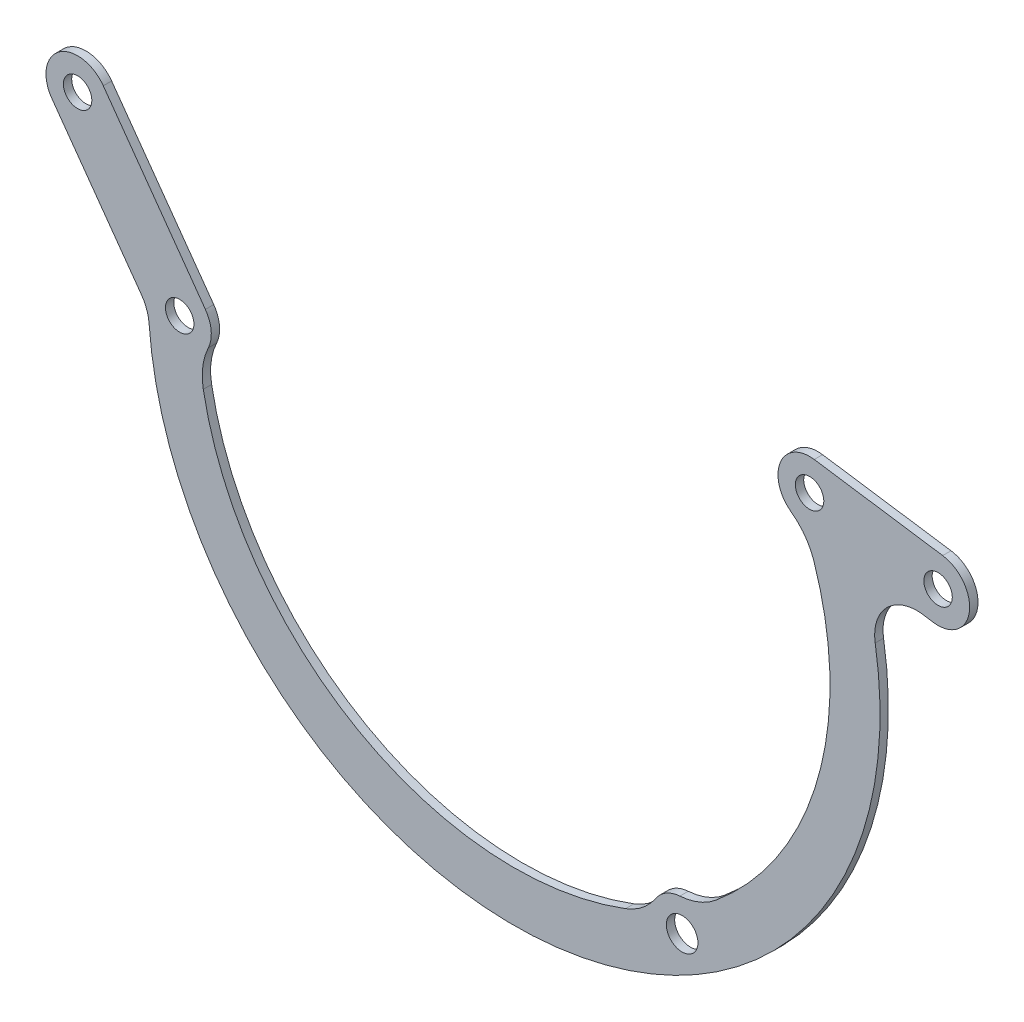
ISO-10303-21;
HEADER;
FILE_DESCRIPTION(('STEP AP214'),'2;1');
FILE_NAME('part.step','',(''),(''),'','','');
FILE_SCHEMA(('AUTOMOTIVE_DESIGN { 1 0 10303 214 1 1 1 1 }'));
ENDSEC;
DATA;
#1=APPLICATION_CONTEXT('core data for automotive mechanical design processes');
#2=APPLICATION_PROTOCOL_DEFINITION('international standard','automotive_design',2000,#1);
#3=PRODUCT_CONTEXT('',#1,'mechanical');
#4=PRODUCT('Part','Part','',(#3));
#5=PRODUCT_RELATED_PRODUCT_CATEGORY('part','',(#4));
#6=PRODUCT_DEFINITION_FORMATION('','',#4);
#7=PRODUCT_DEFINITION_CONTEXT('part definition',#1,'design');
#8=PRODUCT_DEFINITION('design','',#6,#7);
#9=PRODUCT_DEFINITION_SHAPE('','',#8);
#10=(LENGTH_UNIT() NAMED_UNIT(*) SI_UNIT(.MILLI.,.METRE.));
#11=(NAMED_UNIT(*) PLANE_ANGLE_UNIT() SI_UNIT($,.RADIAN.));
#12=(NAMED_UNIT(*) SI_UNIT($,.STERADIAN.) SOLID_ANGLE_UNIT());
#13=UNCERTAINTY_MEASURE_WITH_UNIT(LENGTH_MEASURE(1.E-05),#10,'distance_accuracy_value','');
#14=(GEOMETRIC_REPRESENTATION_CONTEXT(3) GLOBAL_UNCERTAINTY_ASSIGNED_CONTEXT((#13)) GLOBAL_UNIT_ASSIGNED_CONTEXT((#10,
#11,#12)) REPRESENTATION_CONTEXT('',''));
#15=CARTESIAN_POINT('',(0.,0.,0.));
#16=DIRECTION('',(0.,0.,1.));
#17=DIRECTION('',(1.,0.,0.));
#18=AXIS2_PLACEMENT_3D('',#15,#16,#17);
#19=CARTESIAN_POINT('',(0.,0.,1.9812));
#20=DIRECTION('',(0.,0.,1.));
#21=DIRECTION('',(1.,0.,0.));
#22=AXIS2_PLACEMENT_3D('',#19,#20,#21);
#23=PLANE('',#22);
#24=CARTESIAN_POINT('',(-60.75,-101.25,1.9812));
#25=DIRECTION('',(0.,0.,1.));
#26=DIRECTION('',(1.,0.,0.));
#27=AXIS2_PLACEMENT_3D('',#24,#25,#26);
#28=CIRCLE('',#27,3.75000000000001);
#29=CARTESIAN_POINT('',(-57.,-101.25,1.9812));
#30=VERTEX_POINT('',#29);
#31=EDGE_CURVE('E261',#30,#30,#28,.T.);
#32=ORIENTED_EDGE('',*,*,#31,.F.);
#33=EDGE_LOOP('',(#32));
#34=FACE_BOUND('',#33,.T.);
#35=CARTESIAN_POINT('',(-30.4967838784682,4.50794492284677,1.9812));
#36=DIRECTION('',(0.,0.,1.));
#37=DIRECTION('',(1.,0.,0.));
#38=AXIS2_PLACEMENT_3D('',#35,#36,#37);
#39=CIRCLE('',#38,3.375);
#40=CARTESIAN_POINT('',(-27.1217838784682,4.50794492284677,1.9812));
#41=VERTEX_POINT('',#40);
#42=EDGE_CURVE('E296',#41,#41,#39,.T.);
#43=ORIENTED_EDGE('',*,*,#42,.F.);
#44=EDGE_LOOP('',(#43));
#45=FACE_BOUND('',#44,.T.);
#46=CARTESIAN_POINT('',(0.,0.,1.9812));
#47=DIRECTION('',(0.,0.,1.));
#48=DIRECTION('',(1.,0.,0.));
#49=AXIS2_PLACEMENT_3D('',#46,#47,#48);
#50=CIRCLE('',#49,3.375);
#51=CARTESIAN_POINT('',(3.375,0.,1.9812));
#52=VERTEX_POINT('',#51);
#53=EDGE_CURVE('E299',#52,#52,#50,.T.);
#54=ORIENTED_EDGE('',*,*,#53,.F.);
#55=EDGE_LOOP('',(#54));
#56=FACE_BOUND('',#55,.T.);
#57=CARTESIAN_POINT('',(-180.012321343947,-33.8501579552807,1.9812));
#58=DIRECTION('',(0.,0.,1.));
#59=DIRECTION('',(1.,0.,0.));
#60=AXIS2_PLACEMENT_3D('',#57,#58,#59);
#61=CIRCLE('',#60,3.37499999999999);
#62=CARTESIAN_POINT('',(-176.637321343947,-33.8501579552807,1.9812));
#63=VERTEX_POINT('',#62);
#64=EDGE_CURVE('E302',#63,#63,#61,.T.);
#65=ORIENTED_EDGE('',*,*,#64,.F.);
#66=EDGE_LOOP('',(#65));
#67=FACE_BOUND('',#66,.T.);
#68=CARTESIAN_POINT('',(-204.25,0.,1.9812));
#69=DIRECTION('',(0.,0.,1.));
#70=DIRECTION('',(1.,0.,0.));
#71=AXIS2_PLACEMENT_3D('',#68,#69,#70);
#72=CIRCLE('',#71,3.37499999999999);
#73=CARTESIAN_POINT('',(-200.875,0.,1.9812));
#74=VERTEX_POINT('',#73);
#75=EDGE_CURVE('E305',#74,#74,#72,.T.);
#76=ORIENTED_EDGE('',*,*,#75,.F.);
#77=EDGE_LOOP('',(#76));
#78=FACE_BOUND('',#77,.T.);
#79=CARTESIAN_POINT('',(-62.3340688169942,-78.8058309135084,1.9812));
#80=DIRECTION('',(0.,0.,1.));
#81=DIRECTION('',(1.,0.,0.));
#82=AXIS2_PLACEMENT_3D('',#79,#80,#81);
#83=CIRCLE('',#82,15.);
#84=CARTESIAN_POINT('',(-61.2780229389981,-93.7686103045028,1.9812));
#85=VERTEX_POINT('',#84);
#86=CARTESIAN_POINT('',(-52.755842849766,-90.3495559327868,1.9812));
#87=VERTEX_POINT('',#86);
#88=EDGE_CURVE('E221',#85,#87,#83,.T.);
#89=ORIENTED_EDGE('',*,*,#88,.F.);
#90=CARTESIAN_POINT('',(-60.75,-101.25,1.9812));
#91=DIRECTION('',(0.,0.,1.));
#92=DIRECTION('',(1.,0.,0.));
#93=AXIS2_PLACEMENT_3D('',#90,#91,#92);
#94=CIRCLE('',#93,7.5);
#95=CARTESIAN_POINT('',(-66.9905712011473,-97.0900395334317,1.9812));
#96=VERTEX_POINT('',#95);
#97=EDGE_CURVE('E251',#85,#96,#94,.T.);
#98=ORIENTED_EDGE('',*,*,#97,.T.);
#99=CARTESIAN_POINT('',(-79.4717136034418,-88.7701186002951,1.9812));
#100=DIRECTION('',(0.,0.,1.));
#101=DIRECTION('',(1.,0.,0.));
#102=AXIS2_PLACEMENT_3D('',#99,#100,#101);
#103=CIRCLE('',#102,15.);
#104=CARTESIAN_POINT('',(-74.1778988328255,-102.80491554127,1.9812));
#105=VERTEX_POINT('',#104);
#106=EDGE_CURVE('E232',#96,#105,#103,.F.);
#107=ORIENTED_EDGE('',*,*,#106,.T.);
#108=CARTESIAN_POINT('',(-100.646972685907,-32.6309308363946,1.9812));
#109=DIRECTION('',(0.,0.,1.));
#110=DIRECTION('',(1.,0.,0.));
#111=AXIS2_PLACEMENT_3D('',#108,#109,#110);
#112=CIRCLE('',#111,75.);
#113=CARTESIAN_POINT('',(-174.417451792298,-46.1555902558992,1.9812));
#114=VERTEX_POINT('',#113);
#115=EDGE_CURVE('E240',#114,#105,#112,.T.);
#116=ORIENTED_EDGE('',*,*,#115,.F.);
#117=CARTESIAN_POINT('',(-159.663355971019,-43.4506583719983,1.9812));
#118=DIRECTION('',(0.,0.,1.));
#119=DIRECTION('',(1.,0.,0.));
#120=AXIS2_PLACEMENT_3D('',#117,#118,#119);
#121=CIRCLE('',#120,15.);
#122=CARTESIAN_POINT('',(-173.229332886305,-37.0503247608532,1.9812));
#123=VERTEX_POINT('',#122);
#124=EDGE_CURVE('E254',#123,#114,#121,.T.);
#125=ORIENTED_EDGE('',*,*,#124,.F.);
#126=CARTESIAN_POINT('',(-180.012321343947,-33.8501579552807,1.9812));
#127=DIRECTION('',(0.,0.,1.));
#128=DIRECTION('',(1.,0.,0.));
#129=AXIS2_PLACEMENT_3D('',#126,#127,#128);
#130=CIRCLE('',#129,7.49999999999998);
#131=CARTESIAN_POINT('',(-173.914350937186,-29.4838372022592,1.9812));
#132=VERTEX_POINT('',#131);
#133=EDGE_CURVE('E282',#123,#132,#130,.T.);
#134=ORIENTED_EDGE('',*,*,#133,.T.);
#135=DIRECTION('',(0.582176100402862,-0.813062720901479,0.));
#136=VECTOR('',#135,1.);
#137=CARTESIAN_POINT('',(-128.925778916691,-92.3145352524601,1.9812));
#138=LINE('',#137,#136);
#139=CARTESIAN_POINT('',(-198.152029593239,4.3663207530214,1.9812));
#140=VERTEX_POINT('',#139);
#141=EDGE_CURVE('E284',#140,#132,#138,.T.);
#142=ORIENTED_EDGE('',*,*,#141,.F.);
#143=CARTESIAN_POINT('',(-204.25,0.,1.9812));
#144=DIRECTION('',(0.,0.,1.));
#145=DIRECTION('',(1.,0.,0.));
#146=AXIS2_PLACEMENT_3D('',#143,#144,#145);
#147=CIRCLE('',#146,7.49999999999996);
#148=CARTESIAN_POINT('',(-210.347970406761,-4.36632075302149,1.9812));
#149=VERTEX_POINT('',#148);
#150=EDGE_CURVE('E287',#140,#149,#147,.T.);
#151=ORIENTED_EDGE('',*,*,#150,.T.);
#152=DIRECTION('',(0.582176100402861,-0.81306272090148,0.));
#153=VECTOR('',#152,1.);
#154=CARTESIAN_POINT('',(-141.121719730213,-101.047176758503,1.9812));
#155=LINE('',#154,#153);
#156=CARTESIAN_POINT('',(-189.123158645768,-34.0087316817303,1.9812));
#157=VERTEX_POINT('',#156);
#158=EDGE_CURVE('E289',#149,#157,#155,.T.);
#159=ORIENTED_EDGE('',*,*,#158,.T.);
#160=CARTESIAN_POINT('',(-197.253785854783,-39.830492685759,1.9812));
#161=DIRECTION('',(0.,0.,1.));
#162=DIRECTION('',(1.,0.,0.));
#163=AXIS2_PLACEMENT_3D('',#160,#161,#162);
#164=CIRCLE('',#163,10.);
#165=CARTESIAN_POINT('',(-187.281440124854,-39.0873099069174,1.9812));
#166=VERTEX_POINT('',#165);
#167=EDGE_CURVE('E12',#157,#166,#164,.F.);
#168=ORIENTED_EDGE('',*,*,#167,.T.);
#169=CARTESIAN_POINT('',(-100.646972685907,-32.6309308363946,1.9812));
#170=DIRECTION('',(0.,0.,1.));
#171=DIRECTION('',(1.,0.,0.));
#172=AXIS2_PLACEMENT_3D('',#169,#170,#171);
#173=CIRCLE('',#172,86.8747131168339);
#174=CARTESIAN_POINT('',(-14.9188780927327,-18.5628969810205,1.9812));
#175=VERTEX_POINT('',#174);
#176=EDGE_CURVE('E291',#166,#175,#173,.T.);
#177=ORIENTED_EDGE('',*,*,#176,.T.);
#178=CARTESIAN_POINT('',(-5.05086339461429,-16.9435496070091,1.9812));
#179=DIRECTION('',(0.,0.,1.));
#180=DIRECTION('',(1.,0.,0.));
#181=AXIS2_PLACEMENT_3D('',#178,#179,#180);
#182=CIRCLE('',#181,10.);
#183=CARTESIAN_POINT('',(-3.58858181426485,-7.05104069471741,1.9812));
#184=VERTEX_POINT('',#183);
#185=EDGE_CURVE('E366',#175,#184,#182,.F.);
#186=ORIENTED_EDGE('',*,*,#185,.T.);
#187=DIRECTION('',(0.98925089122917,-0.146228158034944,0.));
#188=VECTOR('',#187,1.);
#189=CARTESIAN_POINT('',(-1.09671118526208,-7.41938168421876,1.9812));
#190=LINE('',#189,#188);
#191=CARTESIAN_POINT('',(-1.09671118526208,-7.41938168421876,1.9812));
#192=VERTEX_POINT('',#191);
#193=EDGE_CURVE('E294',#184,#192,#190,.T.);
#194=ORIENTED_EDGE('',*,*,#193,.T.);
#195=CARTESIAN_POINT('',(0.,0.,1.9812));
#196=DIRECTION('',(0.,0.,1.));
#197=DIRECTION('',(1.,0.,0.));
#198=AXIS2_PLACEMENT_3D('',#195,#196,#197);
#199=CIRCLE('',#198,7.49999999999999);
#200=CARTESIAN_POINT('',(1.09671118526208,7.41938168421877,1.9812));
#201=VERTEX_POINT('',#200);
#202=EDGE_CURVE('E274',#192,#201,#199,.T.);
#203=ORIENTED_EDGE('',*,*,#202,.T.);
#204=DIRECTION('',(0.98925089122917,-0.146228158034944,0.));
#205=VECTOR('',#204,1.);
#206=CARTESIAN_POINT('',(1.09671118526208,7.41938168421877,1.9812));
#207=LINE('',#206,#205);
#208=CARTESIAN_POINT('',(-29.4000726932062,11.9273266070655,1.9812));
#209=VERTEX_POINT('',#208);
#210=EDGE_CURVE('E276',#209,#201,#207,.T.);
#211=ORIENTED_EDGE('',*,*,#210,.F.);
#212=CARTESIAN_POINT('',(-30.4967838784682,4.50794492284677,1.9812));
#213=DIRECTION('',(0.,0.,1.));
#214=DIRECTION('',(1.,0.,0.));
#215=AXIS2_PLACEMENT_3D('',#212,#213,#214);
#216=CIRCLE('',#215,7.5);
#217=CARTESIAN_POINT('',(-34.9014289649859,-1.56240116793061,1.9812));
#218=VERTEX_POINT('',#217);
#219=EDGE_CURVE('E280',#209,#218,#216,.T.);
#220=ORIENTED_EDGE('',*,*,#219,.T.);
#221=CARTESIAN_POINT('',(-43.7107191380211,-13.7030933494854,1.9812));
#222=DIRECTION('',(0.,0.,1.));
#223=DIRECTION('',(1.,0.,0.));
#224=AXIS2_PLACEMENT_3D('',#221,#222,#223);
#225=CIRCLE('',#224,15.);
#226=CARTESIAN_POINT('',(-29.4766557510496,-8.97113397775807,1.9812));
#227=VERTEX_POINT('',#226);
#228=EDGE_CURVE('E224',#227,#218,#225,.T.);
#229=ORIENTED_EDGE('',*,*,#228,.F.);
#230=CARTESIAN_POINT('',(-100.646972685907,-32.6309308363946,1.9812));
#231=DIRECTION('',(0.,0.,1.));
#232=DIRECTION('',(1.,0.,0.));
#233=AXIS2_PLACEMENT_3D('',#230,#231,#232);
#234=CIRCLE('',#233,75.);
#235=EDGE_CURVE('E205',#87,#227,#234,.T.);
#236=ORIENTED_EDGE('',*,*,#235,.F.);
#237=EDGE_LOOP('',(#89,#98,#107,#116,#125,#134,#142,#151,#159,#168,#177,#186,#194,#203,#211,
#220,#229,#236));
#238=FACE_BOUND('',#237,.T.);
#239=ADVANCED_FACE('F73',(#34,#45,#56,#67,#78,#238),#23,.T.);
#240=CARTESIAN_POINT('',(0.,0.,0.));
#241=DIRECTION('',(0.,0.,1.));
#242=DIRECTION('',(1.,0.,0.));
#243=AXIS2_PLACEMENT_3D('',#240,#241,#242);
#244=PLANE('',#243);
#245=CARTESIAN_POINT('',(-60.75,-101.25,0.));
#246=DIRECTION('',(0.,0.,1.));
#247=DIRECTION('',(1.,0.,0.));
#248=AXIS2_PLACEMENT_3D('',#245,#246,#247);
#249=CIRCLE('',#248,3.75000000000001);
#250=CARTESIAN_POINT('',(-57.,-101.25,0.));
#251=VERTEX_POINT('',#250);
#252=EDGE_CURVE('E268',#251,#251,#249,.T.);
#253=ORIENTED_EDGE('',*,*,#252,.T.);
#254=EDGE_LOOP('',(#253));
#255=FACE_BOUND('',#254,.T.);
#256=CARTESIAN_POINT('',(-30.4967838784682,4.50794492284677,0.));
#257=DIRECTION('',(0.,0.,1.));
#258=DIRECTION('',(1.,0.,0.));
#259=AXIS2_PLACEMENT_3D('',#256,#257,#258);
#260=CIRCLE('',#259,3.375);
#261=CARTESIAN_POINT('',(-27.1217838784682,4.50794492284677,0.));
#262=VERTEX_POINT('',#261);
#263=EDGE_CURVE('E331',#262,#262,#260,.T.);
#264=ORIENTED_EDGE('',*,*,#263,.T.);
#265=EDGE_LOOP('',(#264));
#266=FACE_BOUND('',#265,.T.);
#267=CARTESIAN_POINT('',(0.,0.,0.));
#268=DIRECTION('',(0.,0.,1.));
#269=DIRECTION('',(1.,0.,0.));
#270=AXIS2_PLACEMENT_3D('',#267,#268,#269);
#271=CIRCLE('',#270,3.375);
#272=CARTESIAN_POINT('',(3.375,0.,0.));
#273=VERTEX_POINT('',#272);
#274=EDGE_CURVE('E334',#273,#273,#271,.T.);
#275=ORIENTED_EDGE('',*,*,#274,.T.);
#276=EDGE_LOOP('',(#275));
#277=FACE_BOUND('',#276,.T.);
#278=CARTESIAN_POINT('',(-180.012321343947,-33.8501579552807,0.));
#279=DIRECTION('',(0.,0.,1.));
#280=DIRECTION('',(1.,0.,0.));
#281=AXIS2_PLACEMENT_3D('',#278,#279,#280);
#282=CIRCLE('',#281,3.37499999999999);
#283=CARTESIAN_POINT('',(-176.637321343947,-33.8501579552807,0.));
#284=VERTEX_POINT('',#283);
#285=EDGE_CURVE('E337',#284,#284,#282,.T.);
#286=ORIENTED_EDGE('',*,*,#285,.T.);
#287=EDGE_LOOP('',(#286));
#288=FACE_BOUND('',#287,.T.);
#289=CARTESIAN_POINT('',(-204.25,0.,0.));
#290=DIRECTION('',(0.,0.,1.));
#291=DIRECTION('',(1.,0.,0.));
#292=AXIS2_PLACEMENT_3D('',#289,#290,#291);
#293=CIRCLE('',#292,3.37499999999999);
#294=CARTESIAN_POINT('',(-200.875,0.,0.));
#295=VERTEX_POINT('',#294);
#296=EDGE_CURVE('E277',#295,#295,#293,.T.);
#297=ORIENTED_EDGE('',*,*,#296,.T.);
#298=EDGE_LOOP('',(#297));
#299=FACE_BOUND('',#298,.T.);
#300=CARTESIAN_POINT('',(-60.75,-101.25,0.));
#301=DIRECTION('',(0.,0.,1.));
#302=DIRECTION('',(1.,0.,0.));
#303=AXIS2_PLACEMENT_3D('',#300,#301,#302);
#304=CIRCLE('',#303,7.5);
#305=CARTESIAN_POINT('',(-61.2780229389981,-93.7686103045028,0.));
#306=VERTEX_POINT('',#305);
#307=CARTESIAN_POINT('',(-66.9905712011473,-97.0900395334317,0.));
#308=VERTEX_POINT('',#307);
#309=EDGE_CURVE('E239',#306,#308,#304,.T.);
#310=ORIENTED_EDGE('',*,*,#309,.F.);
#311=CARTESIAN_POINT('',(-62.3340688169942,-78.8058309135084,0.));
#312=DIRECTION('',(0.,0.,1.));
#313=DIRECTION('',(1.,0.,0.));
#314=AXIS2_PLACEMENT_3D('',#311,#312,#313);
#315=CIRCLE('',#314,15.);
#316=CARTESIAN_POINT('',(-52.755842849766,-90.3495559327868,0.));
#317=VERTEX_POINT('',#316);
#318=EDGE_CURVE('E210',#306,#317,#315,.T.);
#319=ORIENTED_EDGE('',*,*,#318,.T.);
#320=CARTESIAN_POINT('',(-100.646972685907,-32.6309308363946,0.));
#321=DIRECTION('',(0.,0.,1.));
#322=DIRECTION('',(1.,0.,0.));
#323=AXIS2_PLACEMENT_3D('',#320,#321,#322);
#324=CIRCLE('',#323,75.);
#325=CARTESIAN_POINT('',(-29.4766557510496,-8.97113397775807,0.));
#326=VERTEX_POINT('',#325);
#327=EDGE_CURVE('E202',#317,#326,#324,.T.);
#328=ORIENTED_EDGE('',*,*,#327,.T.);
#329=CARTESIAN_POINT('',(-43.7107191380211,-13.7030933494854,0.));
#330=DIRECTION('',(0.,0.,1.));
#331=DIRECTION('',(1.,0.,0.));
#332=AXIS2_PLACEMENT_3D('',#329,#330,#331);
#333=CIRCLE('',#332,15.);
#334=CARTESIAN_POINT('',(-34.9014289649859,-1.56240116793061,0.));
#335=VERTEX_POINT('',#334);
#336=EDGE_CURVE('E214',#326,#335,#333,.T.);
#337=ORIENTED_EDGE('',*,*,#336,.T.);
#338=CARTESIAN_POINT('',(-30.4967838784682,4.50794492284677,0.));
#339=DIRECTION('',(0.,0.,1.));
#340=DIRECTION('',(1.,0.,0.));
#341=AXIS2_PLACEMENT_3D('',#338,#339,#340);
#342=CIRCLE('',#341,7.5);
#343=CARTESIAN_POINT('',(-29.4000726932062,11.9273266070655,0.));
#344=VERTEX_POINT('',#343);
#345=EDGE_CURVE('E314',#344,#335,#342,.T.);
#346=ORIENTED_EDGE('',*,*,#345,.F.);
#347=DIRECTION('',(0.98925089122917,-0.146228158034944,0.));
#348=VECTOR('',#347,1.);
#349=CARTESIAN_POINT('',(1.09671118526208,7.41938168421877,0.));
#350=LINE('',#349,#348);
#351=CARTESIAN_POINT('',(1.09671118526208,7.41938168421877,0.));
#352=VERTEX_POINT('',#351);
#353=EDGE_CURVE('E311',#344,#352,#350,.T.);
#354=ORIENTED_EDGE('',*,*,#353,.T.);
#355=CARTESIAN_POINT('',(0.,0.,0.));
#356=DIRECTION('',(0.,0.,1.));
#357=DIRECTION('',(1.,0.,0.));
#358=AXIS2_PLACEMENT_3D('',#355,#356,#357);
#359=CIRCLE('',#358,7.49999999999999);
#360=CARTESIAN_POINT('',(-1.09671118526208,-7.41938168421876,0.));
#361=VERTEX_POINT('',#360);
#362=EDGE_CURVE('E271',#361,#352,#359,.T.);
#363=ORIENTED_EDGE('',*,*,#362,.F.);
#364=DIRECTION('',(0.98925089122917,-0.146228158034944,0.));
#365=VECTOR('',#364,1.);
#366=CARTESIAN_POINT('',(-1.09671118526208,-7.41938168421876,0.));
#367=LINE('',#366,#365);
#368=CARTESIAN_POINT('',(-3.58858181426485,-7.05104069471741,0.));
#369=VERTEX_POINT('',#368);
#370=EDGE_CURVE('E329',#369,#361,#367,.T.);
#371=ORIENTED_EDGE('',*,*,#370,.F.);
#372=CARTESIAN_POINT('',(-5.05086339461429,-16.9435496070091,0.));
#373=DIRECTION('',(0.,0.,1.));
#374=DIRECTION('',(1.,0.,0.));
#375=AXIS2_PLACEMENT_3D('',#372,#373,#374);
#376=CIRCLE('',#375,10.);
#377=CARTESIAN_POINT('',(-14.9188780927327,-18.5628969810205,0.));
#378=VERTEX_POINT('',#377);
#379=EDGE_CURVE('E364',#369,#378,#376,.T.);
#380=ORIENTED_EDGE('',*,*,#379,.T.);
#381=CARTESIAN_POINT('',(-100.646972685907,-32.6309308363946,0.));
#382=DIRECTION('',(0.,0.,1.));
#383=DIRECTION('',(1.,0.,0.));
#384=AXIS2_PLACEMENT_3D('',#381,#382,#383);
#385=CIRCLE('',#384,86.8747131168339);
#386=CARTESIAN_POINT('',(-187.281440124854,-39.0873099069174,0.));
#387=VERTEX_POINT('',#386);
#388=EDGE_CURVE('E326',#387,#378,#385,.T.);
#389=ORIENTED_EDGE('',*,*,#388,.F.);
#390=CARTESIAN_POINT('',(-197.253785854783,-39.830492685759,0.));
#391=DIRECTION('',(0.,0.,1.));
#392=DIRECTION('',(1.,0.,0.));
#393=AXIS2_PLACEMENT_3D('',#390,#391,#392);
#394=CIRCLE('',#393,10.);
#395=CARTESIAN_POINT('',(-189.123158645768,-34.0087316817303,0.));
#396=VERTEX_POINT('',#395);
#397=EDGE_CURVE('E81',#387,#396,#394,.T.);
#398=ORIENTED_EDGE('',*,*,#397,.T.);
#399=DIRECTION('',(0.582176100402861,-0.81306272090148,0.));
#400=VECTOR('',#399,1.);
#401=CARTESIAN_POINT('',(-141.121719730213,-101.047176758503,0.));
#402=LINE('',#401,#400);
#403=CARTESIAN_POINT('',(-210.347970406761,-4.36632075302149,0.));
#404=VERTEX_POINT('',#403);
#405=EDGE_CURVE('E324',#404,#396,#402,.T.);
#406=ORIENTED_EDGE('',*,*,#405,.F.);
#407=CARTESIAN_POINT('',(-204.25,0.,0.));
#408=DIRECTION('',(0.,0.,1.));
#409=DIRECTION('',(1.,0.,0.));
#410=AXIS2_PLACEMENT_3D('',#407,#408,#409);
#411=CIRCLE('',#410,7.49999999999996);
#412=CARTESIAN_POINT('',(-198.152029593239,4.3663207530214,0.));
#413=VERTEX_POINT('',#412);
#414=EDGE_CURVE('E322',#413,#404,#411,.T.);
#415=ORIENTED_EDGE('',*,*,#414,.F.);
#416=DIRECTION('',(0.582176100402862,-0.813062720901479,0.));
#417=VECTOR('',#416,1.);
#418=CARTESIAN_POINT('',(-128.925778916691,-92.3145352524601,0.));
#419=LINE('',#418,#417);
#420=CARTESIAN_POINT('',(-173.914350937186,-29.4838372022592,0.));
#421=VERTEX_POINT('',#420);
#422=EDGE_CURVE('E319',#413,#421,#419,.T.);
#423=ORIENTED_EDGE('',*,*,#422,.T.);
#424=CARTESIAN_POINT('',(-180.012321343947,-33.8501579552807,0.));
#425=DIRECTION('',(0.,0.,1.));
#426=DIRECTION('',(1.,0.,0.));
#427=AXIS2_PLACEMENT_3D('',#424,#425,#426);
#428=CIRCLE('',#427,7.49999999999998);
#429=CARTESIAN_POINT('',(-173.229332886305,-37.0503247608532,0.));
#430=VERTEX_POINT('',#429);
#431=EDGE_CURVE('E316',#430,#421,#428,.T.);
#432=ORIENTED_EDGE('',*,*,#431,.F.);
#433=CARTESIAN_POINT('',(-159.663355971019,-43.4506583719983,0.));
#434=DIRECTION('',(0.,0.,1.));
#435=DIRECTION('',(1.,0.,0.));
#436=AXIS2_PLACEMENT_3D('',#433,#434,#435);
#437=CIRCLE('',#436,15.);
#438=CARTESIAN_POINT('',(-174.417451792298,-46.1555902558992,0.));
#439=VERTEX_POINT('',#438);
#440=EDGE_CURVE('E242',#430,#439,#437,.T.);
#441=ORIENTED_EDGE('',*,*,#440,.T.);
#442=CARTESIAN_POINT('',(-100.646972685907,-32.6309308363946,0.));
#443=DIRECTION('',(0.,0.,1.));
#444=DIRECTION('',(1.,0.,0.));
#445=AXIS2_PLACEMENT_3D('',#442,#443,#444);
#446=CIRCLE('',#445,75.);
#447=CARTESIAN_POINT('',(-74.1778988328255,-102.80491554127,0.));
#448=VERTEX_POINT('',#447);
#449=EDGE_CURVE('E245',#439,#448,#446,.T.);
#450=ORIENTED_EDGE('',*,*,#449,.T.);
#451=CARTESIAN_POINT('',(-79.4717136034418,-88.7701186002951,0.));
#452=DIRECTION('',(0.,0.,1.));
#453=DIRECTION('',(1.,0.,0.));
#454=AXIS2_PLACEMENT_3D('',#451,#452,#453);
#455=CIRCLE('',#454,15.);
#456=EDGE_CURVE('E237',#308,#448,#455,.F.);
#457=ORIENTED_EDGE('',*,*,#456,.F.);
#458=EDGE_LOOP('',(#310,#319,#328,#337,#346,#354,#363,#371,#380,#389,#398,#406,#415,#423,#432,
#441,#450,#457));
#459=FACE_BOUND('',#458,.T.);
#460=ADVANCED_FACE('F219',(#255,#266,#277,#288,#299,#459),#244,.F.);
#461=CARTESIAN_POINT('',(0.,0.,1.9812));
#462=DIRECTION('',(0.,0.,-1.));
#463=DIRECTION('',(-1.,0.,0.));
#464=AXIS2_PLACEMENT_3D('',#461,#462,#463);
#465=CYLINDRICAL_SURFACE('',#464,7.49999999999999);
#466=ORIENTED_EDGE('',*,*,#362,.T.);
#467=DIRECTION('',(0.,0.,-1.));
#468=VECTOR('',#467,1.);
#469=CARTESIAN_POINT('',(1.09671118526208,7.41938168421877,1.9812));
#470=LINE('',#469,#468);
#471=EDGE_CURVE('E353',#201,#352,#470,.T.);
#472=ORIENTED_EDGE('',*,*,#471,.F.);
#473=ORIENTED_EDGE('',*,*,#202,.F.);
#474=DIRECTION('',(0.,0.,-1.));
#475=VECTOR('',#474,1.);
#476=CARTESIAN_POINT('',(-1.09671118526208,-7.41938168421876,1.9812));
#477=LINE('',#476,#475);
#478=EDGE_CURVE('E308',#192,#361,#477,.T.);
#479=ORIENTED_EDGE('',*,*,#478,.T.);
#480=EDGE_LOOP('',(#466,#472,#473,#479));
#481=FACE_BOUND('',#480,.T.);
#482=ADVANCED_FACE('F428',(#481),#465,.T.);
#483=CARTESIAN_POINT('',(1.09671118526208,7.41938168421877,1.9812));
#484=DIRECTION('',(0.146228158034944,0.98925089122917,0.));
#485=DIRECTION('',(-0.98925089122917,0.146228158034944,0.));
#486=AXIS2_PLACEMENT_3D('',#483,#484,#485);
#487=PLANE('',#486);
#488=ORIENTED_EDGE('',*,*,#353,.F.);
#489=DIRECTION('',(0.,0.,-1.));
#490=VECTOR('',#489,1.);
#491=CARTESIAN_POINT('',(-29.4000726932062,11.9273266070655,1.9812));
#492=LINE('',#491,#490);
#493=EDGE_CURVE('E351',#209,#344,#492,.T.);
#494=ORIENTED_EDGE('',*,*,#493,.F.);
#495=ORIENTED_EDGE('',*,*,#210,.T.);
#496=ORIENTED_EDGE('',*,*,#471,.T.);
#497=EDGE_LOOP('',(#488,#494,#495,#496));
#498=FACE_BOUND('',#497,.T.);
#499=ADVANCED_FACE('F425',(#498),#487,.T.);
#500=CARTESIAN_POINT('',(-30.4967838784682,4.50794492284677,1.9812));
#501=DIRECTION('',(0.,0.,-1.));
#502=DIRECTION('',(-1.,0.,0.));
#503=AXIS2_PLACEMENT_3D('',#500,#501,#502);
#504=CYLINDRICAL_SURFACE('',#503,7.5);
#505=ORIENTED_EDGE('',*,*,#345,.T.);
#506=DIRECTION('',(0.,0.,1.));
#507=VECTOR('',#506,1.);
#508=CARTESIAN_POINT('',(-34.9014289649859,-1.56240116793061,0.));
#509=LINE('',#508,#507);
#510=EDGE_CURVE('E209',#335,#218,#509,.T.);
#511=ORIENTED_EDGE('',*,*,#510,.T.);
#512=ORIENTED_EDGE('',*,*,#219,.F.);
#513=ORIENTED_EDGE('',*,*,#493,.T.);
#514=EDGE_LOOP('',(#505,#511,#512,#513));
#515=FACE_BOUND('',#514,.T.);
#516=ADVANCED_FACE('F422',(#515),#504,.T.);
#517=CARTESIAN_POINT('',(-180.012321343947,-33.8501579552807,1.9812));
#518=DIRECTION('',(0.,0.,-1.));
#519=DIRECTION('',(-1.,0.,0.));
#520=AXIS2_PLACEMENT_3D('',#517,#518,#519);
#521=CYLINDRICAL_SURFACE('',#520,7.49999999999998);
#522=ORIENTED_EDGE('',*,*,#431,.T.);
#523=DIRECTION('',(0.,0.,-1.));
#524=VECTOR('',#523,1.);
#525=CARTESIAN_POINT('',(-173.914350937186,-29.4838372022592,1.9812));
#526=LINE('',#525,#524);
#527=EDGE_CURVE('E349',#132,#421,#526,.T.);
#528=ORIENTED_EDGE('',*,*,#527,.F.);
#529=ORIENTED_EDGE('',*,*,#133,.F.);
#530=DIRECTION('',(0.,0.,1.));
#531=VECTOR('',#530,1.);
#532=CARTESIAN_POINT('',(-173.229332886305,-37.0503247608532,0.));
#533=LINE('',#532,#531);
#534=EDGE_CURVE('E264',#430,#123,#533,.T.);
#535=ORIENTED_EDGE('',*,*,#534,.F.);
#536=EDGE_LOOP('',(#522,#528,#529,#535));
#537=FACE_BOUND('',#536,.T.);
#538=ADVANCED_FACE('F399',(#537),#521,.T.);
#539=CARTESIAN_POINT('',(-128.925778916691,-92.3145352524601,1.9812));
#540=DIRECTION('',(0.813062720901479,0.582176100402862,0.));
#541=DIRECTION('',(-0.582176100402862,0.81306272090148,0.));
#542=AXIS2_PLACEMENT_3D('',#539,#540,#541);
#543=PLANE('',#542);
#544=ORIENTED_EDGE('',*,*,#422,.F.);
#545=DIRECTION('',(0.,0.,-1.));
#546=VECTOR('',#545,1.);
#547=CARTESIAN_POINT('',(-198.152029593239,4.3663207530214,1.9812));
#548=LINE('',#547,#546);
#549=EDGE_CURVE('E347',#140,#413,#548,.T.);
#550=ORIENTED_EDGE('',*,*,#549,.F.);
#551=ORIENTED_EDGE('',*,*,#141,.T.);
#552=ORIENTED_EDGE('',*,*,#527,.T.);
#553=EDGE_LOOP('',(#544,#550,#551,#552));
#554=FACE_BOUND('',#553,.T.);
#555=ADVANCED_FACE('F395',(#554),#543,.T.);
#556=CARTESIAN_POINT('',(-204.25,0.,1.9812));
#557=DIRECTION('',(0.,0.,-1.));
#558=DIRECTION('',(-1.,0.,0.));
#559=AXIS2_PLACEMENT_3D('',#556,#557,#558);
#560=CYLINDRICAL_SURFACE('',#559,7.49999999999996);
#561=ORIENTED_EDGE('',*,*,#414,.T.);
#562=DIRECTION('',(0.,0.,-1.));
#563=VECTOR('',#562,1.);
#564=CARTESIAN_POINT('',(-210.347970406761,-4.36632075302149,1.9812));
#565=LINE('',#564,#563);
#566=EDGE_CURVE('E344',#149,#404,#565,.T.);
#567=ORIENTED_EDGE('',*,*,#566,.F.);
#568=ORIENTED_EDGE('',*,*,#150,.F.);
#569=ORIENTED_EDGE('',*,*,#549,.T.);
#570=EDGE_LOOP('',(#561,#567,#568,#569));
#571=FACE_BOUND('',#570,.T.);
#572=ADVANCED_FACE('F471',(#571),#560,.T.);
#573=CARTESIAN_POINT('',(-141.121719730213,-101.047176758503,1.9812));
#574=DIRECTION('',(0.81306272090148,0.582176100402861,0.));
#575=DIRECTION('',(-0.582176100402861,0.81306272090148,0.));
#576=AXIS2_PLACEMENT_3D('',#573,#574,#575);
#577=PLANE('',#576);
#578=ORIENTED_EDGE('',*,*,#405,.T.);
#579=DIRECTION('',(0.,0.,1.));
#580=VECTOR('',#579,1.);
#581=CARTESIAN_POINT('',(-189.123158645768,-34.0087316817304,1.9812));
#582=LINE('',#581,#580);
#583=EDGE_CURVE('E88',#396,#157,#582,.T.);
#584=ORIENTED_EDGE('',*,*,#583,.T.);
#585=ORIENTED_EDGE('',*,*,#158,.F.);
#586=ORIENTED_EDGE('',*,*,#566,.T.);
#587=EDGE_LOOP('',(#578,#584,#585,#586));
#588=FACE_BOUND('',#587,.T.);
#589=ADVANCED_FACE('F390',(#588),#577,.F.);
#590=CARTESIAN_POINT('',(-100.646972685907,-32.6309308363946,1.9812));
#591=DIRECTION('',(0.,0.,-1.));
#592=DIRECTION('',(-1.,0.,0.));
#593=AXIS2_PLACEMENT_3D('',#590,#591,#592);
#594=CYLINDRICAL_SURFACE('',#593,86.8747131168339);
#595=ORIENTED_EDGE('',*,*,#388,.T.);
#596=DIRECTION('',(0.,0.,-1.));
#597=VECTOR('',#596,1.);
#598=CARTESIAN_POINT('',(-14.9188780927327,-18.5628969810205,1.9812));
#599=LINE('',#598,#597);
#600=EDGE_CURVE('E361',#378,#175,#599,.F.);
#601=ORIENTED_EDGE('',*,*,#600,.T.);
#602=ORIENTED_EDGE('',*,*,#176,.F.);
#603=DIRECTION('',(0.,0.,-1.));
#604=VECTOR('',#603,1.);
#605=CARTESIAN_POINT('',(-187.281440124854,-39.0873099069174,1.9812));
#606=LINE('',#605,#604);
#607=EDGE_CURVE('E358',#166,#387,#606,.T.);
#608=ORIENTED_EDGE('',*,*,#607,.T.);
#609=EDGE_LOOP('',(#595,#601,#602,#608));
#610=FACE_BOUND('',#609,.T.);
#611=ADVANCED_FACE('F383',(#610),#594,.T.);
#612=CARTESIAN_POINT('',(-180.012321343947,-33.8501579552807,1.9812));
#613=DIRECTION('',(0.,0.,-1.));
#614=DIRECTION('',(-1.,0.,0.));
#615=AXIS2_PLACEMENT_3D('',#612,#613,#614);
#616=CYLINDRICAL_SURFACE('',#615,3.37499999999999);
#617=ORIENTED_EDGE('',*,*,#64,.T.);
#618=EDGE_LOOP('',(#617));
#619=FACE_BOUND('',#618,.T.);
#620=ORIENTED_EDGE('',*,*,#285,.F.);
#621=EDGE_LOOP('',(#620));
#622=FACE_BOUND('',#621,.T.);
#623=ADVANCED_FACE('F453',(#619,#622),#616,.F.);
#624=CARTESIAN_POINT('',(0.,0.,1.9812));
#625=DIRECTION('',(0.,0.,-1.));
#626=DIRECTION('',(-1.,0.,0.));
#627=AXIS2_PLACEMENT_3D('',#624,#625,#626);
#628=CYLINDRICAL_SURFACE('',#627,3.375);
#629=ORIENTED_EDGE('',*,*,#53,.T.);
#630=EDGE_LOOP('',(#629));
#631=FACE_BOUND('',#630,.T.);
#632=ORIENTED_EDGE('',*,*,#274,.F.);
#633=EDGE_LOOP('',(#632));
#634=FACE_BOUND('',#633,.T.);
#635=ADVANCED_FACE('F456',(#631,#634),#628,.F.);
#636=CARTESIAN_POINT('',(-30.4967838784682,4.50794492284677,1.9812));
#637=DIRECTION('',(0.,0.,-1.));
#638=DIRECTION('',(-1.,0.,0.));
#639=AXIS2_PLACEMENT_3D('',#636,#637,#638);
#640=CYLINDRICAL_SURFACE('',#639,3.375);
#641=ORIENTED_EDGE('',*,*,#42,.T.);
#642=EDGE_LOOP('',(#641));
#643=FACE_BOUND('',#642,.T.);
#644=ORIENTED_EDGE('',*,*,#263,.F.);
#645=EDGE_LOOP('',(#644));
#646=FACE_BOUND('',#645,.T.);
#647=ADVANCED_FACE('F460',(#643,#646),#640,.F.);
#648=CARTESIAN_POINT('',(-1.09671118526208,-7.41938168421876,1.9812));
#649=DIRECTION('',(0.146228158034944,0.98925089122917,0.));
#650=DIRECTION('',(-0.98925089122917,0.146228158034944,0.));
#651=AXIS2_PLACEMENT_3D('',#648,#649,#650);
#652=PLANE('',#651);
#653=ORIENTED_EDGE('',*,*,#193,.F.);
#654=DIRECTION('',(0.,0.,1.));
#655=VECTOR('',#654,1.);
#656=CARTESIAN_POINT('',(-3.58858181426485,-7.05104069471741,0.));
#657=LINE('',#656,#655);
#658=EDGE_CURVE('E355',#184,#369,#657,.F.);
#659=ORIENTED_EDGE('',*,*,#658,.T.);
#660=ORIENTED_EDGE('',*,*,#370,.T.);
#661=ORIENTED_EDGE('',*,*,#478,.F.);
#662=EDGE_LOOP('',(#653,#659,#660,#661));
#663=FACE_BOUND('',#662,.T.);
#664=ADVANCED_FACE('F377',(#663),#652,.F.);
#665=CARTESIAN_POINT('',(-204.25,0.,1.9812));
#666=DIRECTION('',(0.,0.,-1.));
#667=DIRECTION('',(-1.,0.,0.));
#668=AXIS2_PLACEMENT_3D('',#665,#666,#667);
#669=CYLINDRICAL_SURFACE('',#668,3.37499999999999);
#670=ORIENTED_EDGE('',*,*,#75,.T.);
#671=EDGE_LOOP('',(#670));
#672=FACE_BOUND('',#671,.T.);
#673=ORIENTED_EDGE('',*,*,#296,.F.);
#674=EDGE_LOOP('',(#673));
#675=FACE_BOUND('',#674,.T.);
#676=ADVANCED_FACE('F449',(#672,#675),#669,.F.);
#677=CARTESIAN_POINT('',(-5.05086339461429,-16.9435496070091,1.9812));
#678=DIRECTION('',(0.,0.,-1.));
#679=DIRECTION('',(-1.,0.,0.));
#680=AXIS2_PLACEMENT_3D('',#677,#678,#679);
#681=CYLINDRICAL_SURFACE('',#680,10.);
#682=ORIENTED_EDGE('',*,*,#185,.F.);
#683=ORIENTED_EDGE('',*,*,#600,.F.);
#684=ORIENTED_EDGE('',*,*,#379,.F.);
#685=ORIENTED_EDGE('',*,*,#658,.F.);
#686=EDGE_LOOP('',(#682,#683,#684,#685));
#687=FACE_BOUND('',#686,.T.);
#688=ADVANCED_FACE('F380',(#687),#681,.F.);
#689=CARTESIAN_POINT('',(-197.253785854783,-39.830492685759,1.9812));
#690=DIRECTION('',(0.,0.,-1.));
#691=DIRECTION('',(-1.,0.,0.));
#692=AXIS2_PLACEMENT_3D('',#689,#690,#691);
#693=CYLINDRICAL_SURFACE('',#692,10.);
#694=ORIENTED_EDGE('',*,*,#167,.F.);
#695=ORIENTED_EDGE('',*,*,#583,.F.);
#696=ORIENTED_EDGE('',*,*,#397,.F.);
#697=ORIENTED_EDGE('',*,*,#607,.F.);
#698=EDGE_LOOP('',(#694,#695,#696,#697));
#699=FACE_BOUND('',#698,.T.);
#700=ADVANCED_FACE('F75',(#699),#693,.F.);
#701=CARTESIAN_POINT('',(-60.75,-101.25,0.));
#702=DIRECTION('',(0.,0.,1.));
#703=DIRECTION('',(1.,0.,0.));
#704=AXIS2_PLACEMENT_3D('',#701,#702,#703);
#705=CYLINDRICAL_SURFACE('',#704,3.75000000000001);
#706=ORIENTED_EDGE('',*,*,#252,.F.);
#707=EDGE_LOOP('',(#706));
#708=FACE_BOUND('',#707,.T.);
#709=ORIENTED_EDGE('',*,*,#31,.T.);
#710=EDGE_LOOP('',(#709));
#711=FACE_BOUND('',#710,.T.);
#712=ADVANCED_FACE('F446',(#708,#711),#705,.F.);
#713=CARTESIAN_POINT('',(-79.4717136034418,-88.7701186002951,0.));
#714=DIRECTION('',(0.,0.,1.));
#715=DIRECTION('',(1.,0.,0.));
#716=AXIS2_PLACEMENT_3D('',#713,#714,#715);
#717=CYLINDRICAL_SURFACE('',#716,15.);
#718=ORIENTED_EDGE('',*,*,#106,.F.);
#719=DIRECTION('',(0.,0.,1.));
#720=VECTOR('',#719,1.);
#721=CARTESIAN_POINT('',(-66.9905712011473,-97.0900395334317,0.));
#722=LINE('',#721,#720);
#723=EDGE_CURVE('E248',#308,#96,#722,.T.);
#724=ORIENTED_EDGE('',*,*,#723,.F.);
#725=ORIENTED_EDGE('',*,*,#456,.T.);
#726=DIRECTION('',(0.,0.,1.));
#727=VECTOR('',#726,1.);
#728=CARTESIAN_POINT('',(-74.1778988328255,-102.80491554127,0.));
#729=LINE('',#728,#727);
#730=EDGE_CURVE('E259',#448,#105,#729,.T.);
#731=ORIENTED_EDGE('',*,*,#730,.T.);
#732=EDGE_LOOP('',(#718,#724,#725,#731));
#733=FACE_BOUND('',#732,.T.);
#734=ADVANCED_FACE('F412',(#733),#717,.F.);
#735=CARTESIAN_POINT('',(-100.646972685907,-32.6309308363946,0.));
#736=DIRECTION('',(0.,0.,1.));
#737=DIRECTION('',(1.,0.,0.));
#738=AXIS2_PLACEMENT_3D('',#735,#736,#737);
#739=CYLINDRICAL_SURFACE('',#738,75.);
#740=ORIENTED_EDGE('',*,*,#115,.T.);
#741=ORIENTED_EDGE('',*,*,#730,.F.);
#742=ORIENTED_EDGE('',*,*,#449,.F.);
#743=DIRECTION('',(0.,0.,1.));
#744=VECTOR('',#743,1.);
#745=CARTESIAN_POINT('',(-174.417451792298,-46.1555902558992,0.));
#746=LINE('',#745,#744);
#747=EDGE_CURVE('E262',#439,#114,#746,.T.);
#748=ORIENTED_EDGE('',*,*,#747,.T.);
#749=EDGE_LOOP('',(#740,#741,#742,#748));
#750=FACE_BOUND('',#749,.T.);
#751=ADVANCED_FACE('F409',(#750),#739,.F.);
#752=CARTESIAN_POINT('',(-159.663355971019,-43.4506583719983,0.));
#753=DIRECTION('',(0.,0.,1.));
#754=DIRECTION('',(1.,0.,0.));
#755=AXIS2_PLACEMENT_3D('',#752,#753,#754);
#756=CYLINDRICAL_SURFACE('',#755,15.);
#757=ORIENTED_EDGE('',*,*,#124,.T.);
#758=ORIENTED_EDGE('',*,*,#747,.F.);
#759=ORIENTED_EDGE('',*,*,#440,.F.);
#760=ORIENTED_EDGE('',*,*,#534,.T.);
#761=EDGE_LOOP('',(#757,#758,#759,#760));
#762=FACE_BOUND('',#761,.T.);
#763=ADVANCED_FACE('F404',(#762),#756,.F.);
#764=CARTESIAN_POINT('',(-60.75,-101.25,0.));
#765=DIRECTION('',(0.,0.,1.));
#766=DIRECTION('',(1.,0.,0.));
#767=AXIS2_PLACEMENT_3D('',#764,#765,#766);
#768=CYLINDRICAL_SURFACE('',#767,7.5);
#769=ORIENTED_EDGE('',*,*,#97,.F.);
#770=DIRECTION('',(0.,0.,1.));
#771=VECTOR('',#770,1.);
#772=CARTESIAN_POINT('',(-61.2780229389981,-93.7686103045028,0.));
#773=LINE('',#772,#771);
#774=EDGE_CURVE('E233',#306,#85,#773,.T.);
#775=ORIENTED_EDGE('',*,*,#774,.F.);
#776=ORIENTED_EDGE('',*,*,#309,.T.);
#777=ORIENTED_EDGE('',*,*,#723,.T.);
#778=EDGE_LOOP('',(#769,#775,#776,#777));
#779=FACE_BOUND('',#778,.T.);
#780=ADVANCED_FACE('F416',(#779),#768,.T.);
#781=CARTESIAN_POINT('',(-100.646972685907,-32.6309308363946,0.));
#782=DIRECTION('',(0.,0.,1.));
#783=DIRECTION('',(1.,0.,0.));
#784=AXIS2_PLACEMENT_3D('',#781,#782,#783);
#785=CYLINDRICAL_SURFACE('',#784,75.);
#786=ORIENTED_EDGE('',*,*,#235,.T.);
#787=DIRECTION('',(0.,0.,1.));
#788=VECTOR('',#787,1.);
#789=CARTESIAN_POINT('',(-29.4766557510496,-8.97113397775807,0.));
#790=LINE('',#789,#788);
#791=EDGE_CURVE('E198',#326,#227,#790,.T.);
#792=ORIENTED_EDGE('',*,*,#791,.F.);
#793=ORIENTED_EDGE('',*,*,#327,.F.);
#794=DIRECTION('',(0.,0.,1.));
#795=VECTOR('',#794,1.);
#796=CARTESIAN_POINT('',(-52.755842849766,-90.3495559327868,0.));
#797=LINE('',#796,#795);
#798=EDGE_CURVE('E230',#317,#87,#797,.T.);
#799=ORIENTED_EDGE('',*,*,#798,.T.);
#800=EDGE_LOOP('',(#786,#792,#793,#799));
#801=FACE_BOUND('',#800,.T.);
#802=ADVANCED_FACE('F200',(#801),#785,.F.);
#803=CARTESIAN_POINT('',(-62.3340688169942,-78.8058309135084,0.));
#804=DIRECTION('',(0.,0.,1.));
#805=DIRECTION('',(1.,0.,0.));
#806=AXIS2_PLACEMENT_3D('',#803,#804,#805);
#807=CYLINDRICAL_SURFACE('',#806,15.);
#808=ORIENTED_EDGE('',*,*,#88,.T.);
#809=ORIENTED_EDGE('',*,*,#798,.F.);
#810=ORIENTED_EDGE('',*,*,#318,.F.);
#811=ORIENTED_EDGE('',*,*,#774,.T.);
#812=EDGE_LOOP('',(#808,#809,#810,#811));
#813=FACE_BOUND('',#812,.T.);
#814=ADVANCED_FACE('F418',(#813),#807,.F.);
#815=CARTESIAN_POINT('',(-43.7107191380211,-13.7030933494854,0.));
#816=DIRECTION('',(0.,0.,1.));
#817=DIRECTION('',(1.,0.,0.));
#818=AXIS2_PLACEMENT_3D('',#815,#816,#817);
#819=CYLINDRICAL_SURFACE('',#818,15.);
#820=ORIENTED_EDGE('',*,*,#228,.T.);
#821=ORIENTED_EDGE('',*,*,#510,.F.);
#822=ORIENTED_EDGE('',*,*,#336,.F.);
#823=ORIENTED_EDGE('',*,*,#791,.T.);
#824=EDGE_LOOP('',(#820,#821,#822,#823));
#825=FACE_BOUND('',#824,.T.);
#826=ADVANCED_FACE('F215',(#825),#819,.F.);
#827=CLOSED_SHELL('',(#239,#460,#482,#499,#516,#538,#555,#572,#589,#611,#623,#635,#647,#664,
#676,#688,#700,#712,#734,#751,#763,#780,#802,#814,#826));
#828=MANIFOLD_SOLID_BREP('B2',#827);
#829=ADVANCED_BREP_SHAPE_REPRESENTATION('',(#18,#828),#14);
#830=SHAPE_DEFINITION_REPRESENTATION(#9,#829);
ENDSEC;
END-ISO-10303-21;
